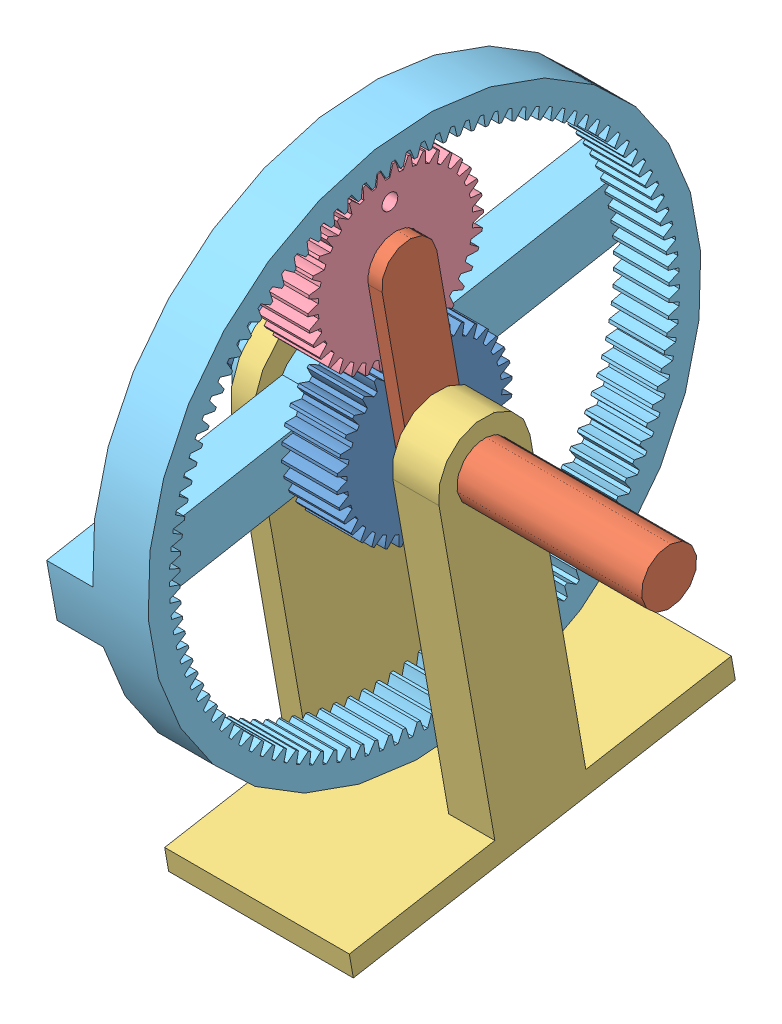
SolidWorks assembly trainepi3 - Corrige.SLDASM, configuration Défaut (file format 6000). Lengths in mm.
Overall size (103 150.82 139.54).
5 component instances, 5 part files, 8 mates.
Components (placement in the parent):
- pignon1(36)-1: pignon1(36).SLDPRT [Défaut] at (4.5753 0 0) x (1 0 0) z (0 -0.157582 0.987506) size (50 37.9 37.9)
- portesatellite-1: portesatellite.SLDPRT [Défaut] at (69.5753 0 0) x (0 -0.173837 0.984774) z (-1 0 0) size (12 48 63)
- bati-1: bati.SLDPRT [Défaut] at (19.5753 0 0) x (0 0.173037 -0.984915) z (1 0 0) size (84 90.22 40)
- satellite(36)-1: satellite(36).SLDPRT [Défaut] at (16.5753 35.4519 6.2581) x (-1 0 0) z (0 0.101313 -0.994855) size (12 37.9 37.9)
- couronne(108)-1: couronne(108).SLDPRT [Défaut] at (4.5753 0 0) x (1 0 0) z (0 0.983844 0.17903) size (32 120 120)
Mates (geometry in assembly coordinates):
- Coïncidente2: coincident anti-aligned: plane of pignon1(36)-1 through (16.5753 0 0) normal (1 0 0); plane of portesatellite-1 through (16.5753 35.4519 6.2581) normal (-1 0 0)
- Coaxiale4: concentric anti-aligned: cylinder of portesatellite-1 through (19.5753 0 0) axis (1 0 0) radius 6; cylinder of bati-1 through (29.5753 0 0) axis (-1 0 0) radius 6
- Coïncidente4: coincident anti-aligned: plane of portesatellite-1 through (19.5753 35.4519 6.2581) normal (1 0 0); plane of bati-1 through (19.5753 0 0) normal (-1 0 0)
- Coaxiale5: concentric anti-aligned: cylinder of pignon1(36)-1 through (-33.4247 0 0) axis (1 0 0) radius 6; cylinder of couronne(108)-1 through (16.5753 0 0) axis (-1 0 0) radius 6
- Coaxiale7: concentric aligned: cylinder of portesatellite-1 through (16.5753 35.4519 6.2581) axis (1 0 0) radius 6; cylinder of satellite(36)-1 through (-33.4247 35.4519 6.2581) axis (1 0 0) radius 6
- Coïncidente7: coincident anti-aligned: plane of portesatellite-1 through (16.5753 35.4519 6.2581) normal (-1 0 0); plane of satellite(36)-1 through (16.5753 35.4519 6.2581) normal (1 0 0)
- Coaxiale8: concentric aligned: cylinder of pignon1(36)-1 through (-33.4247 0 0) axis (1 0 0) radius 6; cylinder of portesatellite-1 through (19.5753 0 0) axis (1 0 0) radius 6
- Coïncidente8: coincident aligned: plane of satellite(36)-1 through (16.5753 35.4519 6.2581) normal (1 0 0); plane of couronne(108)-1 through (16.5753 -52.1437 -9.4886) normal (1 0 0)
